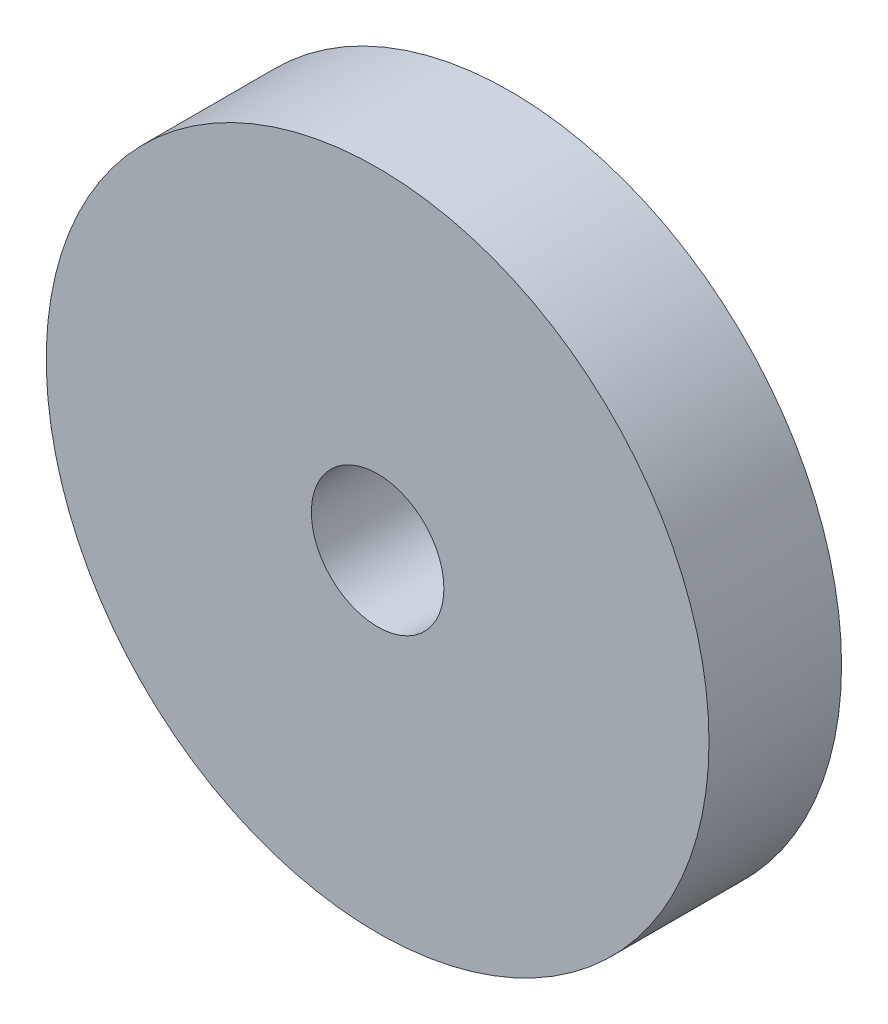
from build123d import *

# Parameters (mm, degrees)
ESQUISSE1_R      = 15
ESQUISSE1_R_2    = 3
EXTRUSION1_DEPTH = 6


with BuildPart() as part:
    # Esquisse1 → Extrusion1 (new body)
    with BuildSketch(Plane.XY):
        Circle(ESQUISSE1_R)
        Circle(ESQUISSE1_R_2, mode=Mode.SUBTRACT)
    extrude(amount=EXTRUSION1_DEPTH)


solid = part.part
